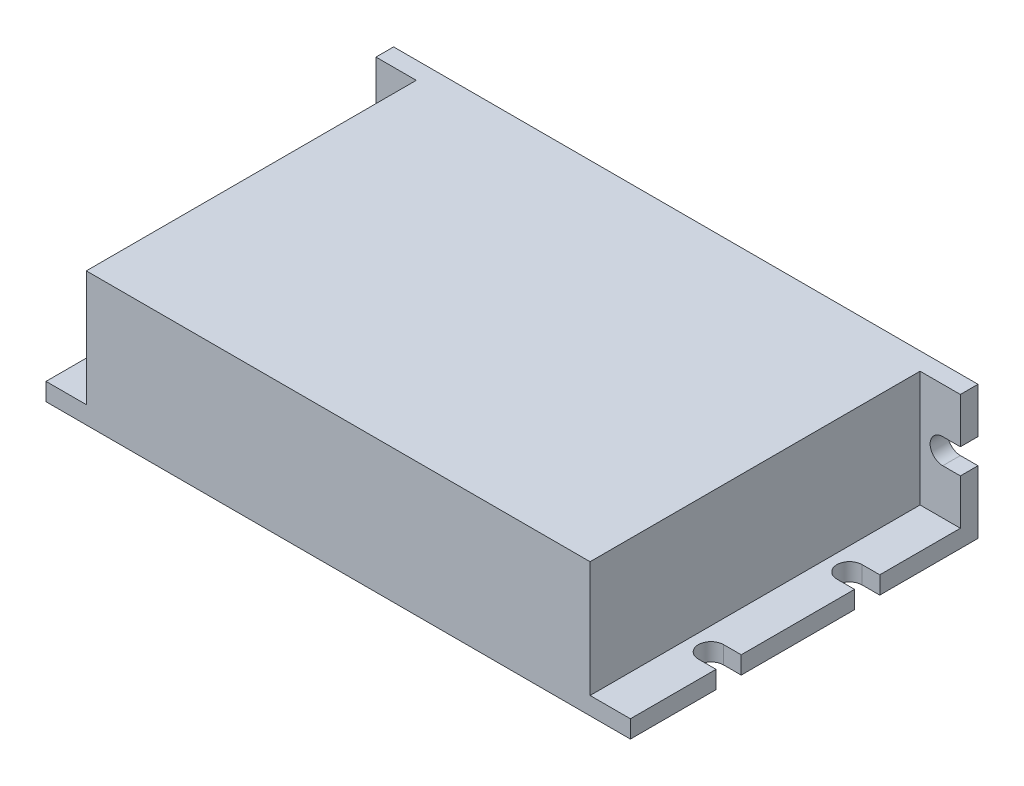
ISO-10303-21;
HEADER;
FILE_DESCRIPTION(('STEP AP214'),'2;1');
FILE_NAME('part.step','',(''),(''),'','','');
FILE_SCHEMA(('AUTOMOTIVE_DESIGN { 1 0 10303 214 1 1 1 1 }'));
ENDSEC;
DATA;
#1=APPLICATION_CONTEXT('core data for automotive mechanical design processes');
#2=APPLICATION_PROTOCOL_DEFINITION('international standard','automotive_design',2000,#1);
#3=PRODUCT_CONTEXT('',#1,'mechanical');
#4=PRODUCT('Part','Part','',(#3));
#5=PRODUCT_RELATED_PRODUCT_CATEGORY('part','',(#4));
#6=PRODUCT_DEFINITION_FORMATION('','',#4);
#7=PRODUCT_DEFINITION_CONTEXT('part definition',#1,'design');
#8=PRODUCT_DEFINITION('design','',#6,#7);
#9=PRODUCT_DEFINITION_SHAPE('','',#8);
#10=(LENGTH_UNIT() NAMED_UNIT(*) SI_UNIT(.MILLI.,.METRE.));
#11=(NAMED_UNIT(*) PLANE_ANGLE_UNIT() SI_UNIT($,.RADIAN.));
#12=(NAMED_UNIT(*) SI_UNIT($,.STERADIAN.) SOLID_ANGLE_UNIT());
#13=UNCERTAINTY_MEASURE_WITH_UNIT(LENGTH_MEASURE(1.E-05),#10,'distance_accuracy_value','');
#14=(GEOMETRIC_REPRESENTATION_CONTEXT(3) GLOBAL_UNCERTAINTY_ASSIGNED_CONTEXT((#13)) GLOBAL_UNIT_ASSIGNED_CONTEXT((#10,
#11,#12)) REPRESENTATION_CONTEXT('',''));
#15=CARTESIAN_POINT('',(0.,0.,0.));
#16=DIRECTION('',(0.,0.,1.));
#17=DIRECTION('',(1.,0.,0.));
#18=AXIS2_PLACEMENT_3D('',#15,#16,#17);
#19=CARTESIAN_POINT('',(0.,0.,0.));
#20=DIRECTION('',(0.,-1.,0.));
#21=DIRECTION('',(0.,0.,-1.));
#22=AXIS2_PLACEMENT_3D('',#19,#20,#21);
#23=PLANE('',#22);
#24=CARTESIAN_POINT('',(3.5,0.,-19.5));
#25=DIRECTION('',(0.,1.,0.));
#26=DIRECTION('',(0.,0.,-1.));
#27=AXIS2_PLACEMENT_3D('',#24,#25,#26);
#28=CIRCLE('',#27,2.5);
#29=CARTESIAN_POINT('',(3.5,0.,-17.));
#30=VERTEX_POINT('',#29);
#31=CARTESIAN_POINT('',(3.5,0.,-22.));
#32=VERTEX_POINT('',#31);
#33=EDGE_CURVE('E286',#30,#32,#28,.T.);
#34=ORIENTED_EDGE('',*,*,#33,.T.);
#35=DIRECTION('',(-1.,0.,0.));
#36=VECTOR('',#35,1.);
#37=CARTESIAN_POINT('',(3.5,0.,-22.));
#38=LINE('',#37,#36);
#39=CARTESIAN_POINT('',(0.,0.,-22.));
#40=VERTEX_POINT('',#39);
#41=EDGE_CURVE('E273',#32,#40,#38,.T.);
#42=ORIENTED_EDGE('',*,*,#41,.T.);
#43=DIRECTION('',(0.,0.,1.));
#44=VECTOR('',#43,1.);
#45=CARTESIAN_POINT('',(0.,0.,0.));
#46=LINE('',#45,#44);
#47=CARTESIAN_POINT('',(0.,0.,-44.5));
#48=VERTEX_POINT('',#47);
#49=EDGE_CURVE('E489',#48,#40,#46,.T.);
#50=ORIENTED_EDGE('',*,*,#49,.F.);
#51=DIRECTION('',(1.,0.,0.));
#52=VECTOR('',#51,1.);
#53=CARTESIAN_POINT('',(3.5,0.,-44.5));
#54=LINE('',#53,#52);
#55=CARTESIAN_POINT('',(3.5,0.,-44.5));
#56=VERTEX_POINT('',#55);
#57=EDGE_CURVE('E274',#48,#56,#54,.T.);
#58=ORIENTED_EDGE('',*,*,#57,.T.);
#59=CARTESIAN_POINT('',(3.5,0.,-47.));
#60=DIRECTION('',(0.,1.,0.));
#61=DIRECTION('',(0.,0.,-1.));
#62=AXIS2_PLACEMENT_3D('',#59,#60,#61);
#63=CIRCLE('',#62,2.5);
#64=CARTESIAN_POINT('',(3.5,0.,-49.5));
#65=VERTEX_POINT('',#64);
#66=EDGE_CURVE('E304',#56,#65,#63,.T.);
#67=ORIENTED_EDGE('',*,*,#66,.T.);
#68=DIRECTION('',(-1.,0.,0.));
#69=VECTOR('',#68,1.);
#70=CARTESIAN_POINT('',(3.5,0.,-49.5));
#71=LINE('',#70,#69);
#72=CARTESIAN_POINT('',(0.,0.,-49.5));
#73=VERTEX_POINT('',#72);
#74=EDGE_CURVE('E297',#65,#73,#71,.T.);
#75=ORIENTED_EDGE('',*,*,#74,.T.);
#76=CARTESIAN_POINT('',(0.,0.,-69.));
#77=VERTEX_POINT('',#76);
#78=EDGE_CURVE('E485',#77,#73,#46,.T.);
#79=ORIENTED_EDGE('',*,*,#78,.F.);
#80=DIRECTION('',(-1.,0.,0.));
#81=VECTOR('',#80,1.);
#82=CARTESIAN_POINT('',(0.,0.,-69.));
#83=LINE('',#82,#81);
#84=CARTESIAN_POINT('',(116.,0.,-69.));
#85=VERTEX_POINT('',#84);
#86=EDGE_CURVE('E477',#85,#77,#83,.T.);
#87=ORIENTED_EDGE('',*,*,#86,.F.);
#88=DIRECTION('',(0.,0.,-1.));
#89=VECTOR('',#88,1.);
#90=CARTESIAN_POINT('',(116.,0.,0.));
#91=LINE('',#90,#89);
#92=CARTESIAN_POINT('',(116.,0.,-49.5));
#93=VERTEX_POINT('',#92);
#94=EDGE_CURVE('E492',#93,#85,#91,.T.);
#95=ORIENTED_EDGE('',*,*,#94,.F.);
#96=DIRECTION('',(-1.,0.,0.));
#97=VECTOR('',#96,1.);
#98=CARTESIAN_POINT('',(112.5,0.,-49.5));
#99=LINE('',#98,#97);
#100=CARTESIAN_POINT('',(112.5,0.,-49.5));
#101=VERTEX_POINT('',#100);
#102=EDGE_CURVE('E341',#93,#101,#99,.T.);
#103=ORIENTED_EDGE('',*,*,#102,.T.);
#104=CARTESIAN_POINT('',(112.5,0.,-47.));
#105=DIRECTION('',(0.,1.,0.));
#106=DIRECTION('',(0.,0.,1.));
#107=AXIS2_PLACEMENT_3D('',#104,#105,#106);
#108=CIRCLE('',#107,2.5);
#109=CARTESIAN_POINT('',(112.5,0.,-44.5));
#110=VERTEX_POINT('',#109);
#111=EDGE_CURVE('E353',#101,#110,#108,.T.);
#112=ORIENTED_EDGE('',*,*,#111,.T.);
#113=DIRECTION('',(1.,0.,0.));
#114=VECTOR('',#113,1.);
#115=CARTESIAN_POINT('',(112.5,0.,-44.5));
#116=LINE('',#115,#114);
#117=CARTESIAN_POINT('',(116.,0.,-44.5));
#118=VERTEX_POINT('',#117);
#119=EDGE_CURVE('E345',#110,#118,#116,.T.);
#120=ORIENTED_EDGE('',*,*,#119,.T.);
#121=CARTESIAN_POINT('',(116.,0.,-22.));
#122=VERTEX_POINT('',#121);
#123=EDGE_CURVE('E496',#122,#118,#91,.T.);
#124=ORIENTED_EDGE('',*,*,#123,.F.);
#125=DIRECTION('',(-1.,0.,0.));
#126=VECTOR('',#125,1.);
#127=CARTESIAN_POINT('',(112.5,0.,-22.));
#128=LINE('',#127,#126);
#129=CARTESIAN_POINT('',(112.5,0.,-22.));
#130=VERTEX_POINT('',#129);
#131=EDGE_CURVE('E316',#122,#130,#128,.T.);
#132=ORIENTED_EDGE('',*,*,#131,.T.);
#133=CARTESIAN_POINT('',(112.5,0.,-19.5));
#134=DIRECTION('',(0.,1.,0.));
#135=DIRECTION('',(0.,0.,1.));
#136=AXIS2_PLACEMENT_3D('',#133,#134,#135);
#137=CIRCLE('',#136,2.5);
#138=CARTESIAN_POINT('',(112.5,0.,-17.));
#139=VERTEX_POINT('',#138);
#140=EDGE_CURVE('E328',#130,#139,#137,.T.);
#141=ORIENTED_EDGE('',*,*,#140,.T.);
#142=DIRECTION('',(1.,0.,0.));
#143=VECTOR('',#142,1.);
#144=CARTESIAN_POINT('',(112.5,0.,-17.));
#145=LINE('',#144,#143);
#146=CARTESIAN_POINT('',(116.,0.,-17.));
#147=VERTEX_POINT('',#146);
#148=EDGE_CURVE('E320',#139,#147,#145,.T.);
#149=ORIENTED_EDGE('',*,*,#148,.T.);
#150=CARTESIAN_POINT('',(116.,0.,0.));
#151=VERTEX_POINT('',#150);
#152=EDGE_CURVE('E493',#151,#147,#91,.T.);
#153=ORIENTED_EDGE('',*,*,#152,.F.);
#154=DIRECTION('',(1.,0.,0.));
#155=VECTOR('',#154,1.);
#156=CARTESIAN_POINT('',(0.,0.,0.));
#157=LINE('',#156,#155);
#158=CARTESIAN_POINT('',(0.,0.,0.));
#159=VERTEX_POINT('',#158);
#160=EDGE_CURVE('E488',#159,#151,#157,.T.);
#161=ORIENTED_EDGE('',*,*,#160,.F.);
#162=CARTESIAN_POINT('',(0.,0.,-17.));
#163=VERTEX_POINT('',#162);
#164=EDGE_CURVE('E467',#163,#159,#46,.T.);
#165=ORIENTED_EDGE('',*,*,#164,.F.);
#166=DIRECTION('',(1.,0.,0.));
#167=VECTOR('',#166,1.);
#168=CARTESIAN_POINT('',(3.5,0.,-17.));
#169=LINE('',#168,#167);
#170=EDGE_CURVE('E267',#163,#30,#169,.T.);
#171=ORIENTED_EDGE('',*,*,#170,.T.);
#172=EDGE_LOOP('',(#34,#42,#50,#58,#67,#75,#79,#87,#95,#103,#112,#120,#124,#132,#141,#149,#153,
#161,#165,#171));
#173=FACE_BOUND('',#172,.T.);
#174=ADVANCED_FACE('F35',(#173),#23,.T.);
#175=CARTESIAN_POINT('',(0.,26.5,0.));
#176=DIRECTION('',(1.,0.,0.));
#177=DIRECTION('',(0.,0.,-1.));
#178=AXIS2_PLACEMENT_3D('',#175,#176,#177);
#179=PLANE('',#178);
#180=DIRECTION('',(0.,-1.,0.));
#181=VECTOR('',#180,1.);
#182=CARTESIAN_POINT('',(0.,3.5,-22.));
#183=LINE('',#182,#181);
#184=CARTESIAN_POINT('',(0.,3.5,-22.));
#185=VERTEX_POINT('',#184);
#186=EDGE_CURVE('E275',#185,#40,#183,.T.);
#187=ORIENTED_EDGE('',*,*,#186,.F.);
#188=DIRECTION('',(0.,0.,1.));
#189=VECTOR('',#188,1.);
#190=CARTESIAN_POINT('',(0.,3.5,-65.5));
#191=LINE('',#190,#189);
#192=CARTESIAN_POINT('',(0.,3.5,-44.5));
#193=VERTEX_POINT('',#192);
#194=EDGE_CURVE('E281',#193,#185,#191,.T.);
#195=ORIENTED_EDGE('',*,*,#194,.F.);
#196=DIRECTION('',(0.,-1.,0.));
#197=VECTOR('',#196,1.);
#198=CARTESIAN_POINT('',(0.,3.5,-44.5));
#199=LINE('',#198,#197);
#200=EDGE_CURVE('E313',#193,#48,#199,.T.);
#201=ORIENTED_EDGE('',*,*,#200,.T.);
#202=ORIENTED_EDGE('',*,*,#49,.T.);
#203=EDGE_LOOP('',(#187,#195,#201,#202));
#204=FACE_BOUND('',#203,.T.);
#205=ADVANCED_FACE('F37',(#204),#179,.F.);
#206=DIRECTION('',(0.,-1.,0.));
#207=VECTOR('',#206,1.);
#208=CARTESIAN_POINT('',(0.,3.5,-17.));
#209=LINE('',#208,#207);
#210=CARTESIAN_POINT('',(0.,3.5,-17.));
#211=VERTEX_POINT('',#210);
#212=EDGE_CURVE('E50',#211,#163,#209,.T.);
#213=ORIENTED_EDGE('',*,*,#212,.T.);
#214=ORIENTED_EDGE('',*,*,#164,.T.);
#215=DIRECTION('',(0.,-1.,0.));
#216=VECTOR('',#215,1.);
#217=CARTESIAN_POINT('',(0.,26.5,0.));
#218=LINE('',#217,#216);
#219=CARTESIAN_POINT('',(0.,3.5,0.));
#220=VERTEX_POINT('',#219);
#221=EDGE_CURVE('E11',#220,#159,#218,.T.);
#222=ORIENTED_EDGE('',*,*,#221,.F.);
#223=EDGE_CURVE('E459',#211,#220,#191,.T.);
#224=ORIENTED_EDGE('',*,*,#223,.F.);
#225=EDGE_LOOP('',(#213,#214,#222,#224));
#226=FACE_BOUND('',#225,.T.);
#227=ADVANCED_FACE('F622',(#226),#179,.F.);
#228=CARTESIAN_POINT('',(0.,3.5,-65.5));
#229=DIRECTION('',(0.,-1.,0.));
#230=DIRECTION('',(0.,0.,-1.));
#231=AXIS2_PLACEMENT_3D('',#228,#229,#230);
#232=PLANE('',#231);
#233=DIRECTION('',(-1.,0.,0.));
#234=VECTOR('',#233,1.);
#235=CARTESIAN_POINT('',(3.5,3.5,-22.));
#236=LINE('',#235,#234);
#237=CARTESIAN_POINT('',(3.5,3.5,-22.));
#238=VERTEX_POINT('',#237);
#239=EDGE_CURVE('E266',#238,#185,#236,.T.);
#240=ORIENTED_EDGE('',*,*,#239,.F.);
#241=CARTESIAN_POINT('',(3.5,3.5,-19.5));
#242=DIRECTION('',(0.,1.,0.));
#243=DIRECTION('',(0.,0.,-1.));
#244=AXIS2_PLACEMENT_3D('',#241,#242,#243);
#245=CIRCLE('',#244,2.5);
#246=CARTESIAN_POINT('',(3.5,3.5,-17.));
#247=VERTEX_POINT('',#246);
#248=EDGE_CURVE('E257',#247,#238,#245,.T.);
#249=ORIENTED_EDGE('',*,*,#248,.F.);
#250=DIRECTION('',(1.,0.,0.));
#251=VECTOR('',#250,1.);
#252=CARTESIAN_POINT('',(3.5,3.5,-17.));
#253=LINE('',#252,#251);
#254=EDGE_CURVE('E282',#211,#247,#253,.T.);
#255=ORIENTED_EDGE('',*,*,#254,.F.);
#256=ORIENTED_EDGE('',*,*,#223,.T.);
#257=DIRECTION('',(1.,0.,0.));
#258=VECTOR('',#257,1.);
#259=CARTESIAN_POINT('',(0.,3.5,0.));
#260=LINE('',#259,#258);
#261=CARTESIAN_POINT('',(8.,3.5,0.));
#262=VERTEX_POINT('',#261);
#263=EDGE_CURVE('E442',#220,#262,#260,.T.);
#264=ORIENTED_EDGE('',*,*,#263,.T.);
#265=DIRECTION('',(0.,0.,1.));
#266=VECTOR('',#265,1.);
#267=CARTESIAN_POINT('',(8.,3.5,-65.5));
#268=LINE('',#267,#266);
#269=CARTESIAN_POINT('',(8.,3.5,-65.5));
#270=VERTEX_POINT('',#269);
#271=EDGE_CURVE('E468',#270,#262,#268,.T.);
#272=ORIENTED_EDGE('',*,*,#271,.F.);
#273=DIRECTION('',(1.,0.,0.));
#274=VECTOR('',#273,1.);
#275=CARTESIAN_POINT('',(0.,3.5,-65.5));
#276=LINE('',#275,#274);
#277=CARTESIAN_POINT('',(0.,3.5,-65.5));
#278=VERTEX_POINT('',#277);
#279=EDGE_CURVE('E451',#278,#270,#276,.T.);
#280=ORIENTED_EDGE('',*,*,#279,.F.);
#281=CARTESIAN_POINT('',(0.,3.5,-49.5));
#282=VERTEX_POINT('',#281);
#283=EDGE_CURVE('E470',#278,#282,#191,.T.);
#284=ORIENTED_EDGE('',*,*,#283,.T.);
#285=DIRECTION('',(-1.,0.,0.));
#286=VECTOR('',#285,1.);
#287=CARTESIAN_POINT('',(3.5,3.5,-49.5));
#288=LINE('',#287,#286);
#289=CARTESIAN_POINT('',(3.5,3.5,-49.5));
#290=VERTEX_POINT('',#289);
#291=EDGE_CURVE('E299',#290,#282,#288,.T.);
#292=ORIENTED_EDGE('',*,*,#291,.F.);
#293=CARTESIAN_POINT('',(3.5,3.5,-47.));
#294=DIRECTION('',(0.,1.,0.));
#295=DIRECTION('',(0.,0.,-1.));
#296=AXIS2_PLACEMENT_3D('',#293,#294,#295);
#297=CIRCLE('',#296,2.5);
#298=CARTESIAN_POINT('',(3.5,3.5,-44.5));
#299=VERTEX_POINT('',#298);
#300=EDGE_CURVE('E296',#299,#290,#297,.T.);
#301=ORIENTED_EDGE('',*,*,#300,.F.);
#302=DIRECTION('',(1.,0.,0.));
#303=VECTOR('',#302,1.);
#304=CARTESIAN_POINT('',(3.5,3.5,-44.5));
#305=LINE('',#304,#303);
#306=EDGE_CURVE('E294',#193,#299,#305,.T.);
#307=ORIENTED_EDGE('',*,*,#306,.F.);
#308=ORIENTED_EDGE('',*,*,#194,.T.);
#309=EDGE_LOOP('',(#240,#249,#255,#256,#264,#272,#280,#284,#292,#301,#307,#308));
#310=FACE_BOUND('',#309,.T.);
#311=ADVANCED_FACE('F278',(#310),#232,.F.);
#312=DIRECTION('',(0.,-1.,0.));
#313=VECTOR('',#312,1.);
#314=CARTESIAN_POINT('',(0.,3.5,-49.5));
#315=LINE('',#314,#313);
#316=EDGE_CURVE('E301',#282,#73,#315,.T.);
#317=ORIENTED_EDGE('',*,*,#316,.F.);
#318=ORIENTED_EDGE('',*,*,#283,.F.);
#319=DIRECTION('',(0.,-1.,0.));
#320=VECTOR('',#319,1.);
#321=CARTESIAN_POINT('',(0.,26.5,-65.5));
#322=LINE('',#321,#320);
#323=CARTESIAN_POINT('',(0.,12.5,-65.5));
#324=VERTEX_POINT('',#323);
#325=EDGE_CURVE('E452',#324,#278,#322,.T.);
#326=ORIENTED_EDGE('',*,*,#325,.F.);
#327=DIRECTION('',(0.,0.,1.));
#328=VECTOR('',#327,1.);
#329=CARTESIAN_POINT('',(0.,12.5,-69.));
#330=LINE('',#329,#328);
#331=CARTESIAN_POINT('',(0.,12.5,-69.));
#332=VERTEX_POINT('',#331);
#333=EDGE_CURVE('E404',#332,#324,#330,.T.);
#334=ORIENTED_EDGE('',*,*,#333,.F.);
#335=DIRECTION('',(0.,-1.,0.));
#336=VECTOR('',#335,1.);
#337=CARTESIAN_POINT('',(0.,26.5,-69.));
#338=LINE('',#337,#336);
#339=EDGE_CURVE('E484',#332,#77,#338,.T.);
#340=ORIENTED_EDGE('',*,*,#339,.T.);
#341=ORIENTED_EDGE('',*,*,#78,.T.);
#342=EDGE_LOOP('',(#317,#318,#326,#334,#340,#341));
#343=FACE_BOUND('',#342,.T.);
#344=ADVANCED_FACE('F555',(#343),#179,.F.);
#345=CARTESIAN_POINT('',(116.,26.5,0.));
#346=DIRECTION('',(-1.,0.,0.));
#347=DIRECTION('',(0.,0.,1.));
#348=AXIS2_PLACEMENT_3D('',#345,#346,#347);
#349=PLANE('',#348);
#350=DIRECTION('',(0.,-1.,0.));
#351=VECTOR('',#350,1.);
#352=CARTESIAN_POINT('',(116.,3.5,-22.));
#353=LINE('',#352,#351);
#354=CARTESIAN_POINT('',(116.,3.5,-22.));
#355=VERTEX_POINT('',#354);
#356=EDGE_CURVE('E338',#355,#122,#353,.T.);
#357=ORIENTED_EDGE('',*,*,#356,.T.);
#358=ORIENTED_EDGE('',*,*,#123,.T.);
#359=DIRECTION('',(0.,-1.,0.));
#360=VECTOR('',#359,1.);
#361=CARTESIAN_POINT('',(116.,3.5,-44.5));
#362=LINE('',#361,#360);
#363=CARTESIAN_POINT('',(116.,3.5,-44.5));
#364=VERTEX_POINT('',#363);
#365=EDGE_CURVE('E350',#364,#118,#362,.T.);
#366=ORIENTED_EDGE('',*,*,#365,.F.);
#367=DIRECTION('',(0.,0.,1.));
#368=VECTOR('',#367,1.);
#369=CARTESIAN_POINT('',(116.,3.5,-65.5));
#370=LINE('',#369,#368);
#371=EDGE_CURVE('E443',#364,#355,#370,.T.);
#372=ORIENTED_EDGE('',*,*,#371,.T.);
#373=EDGE_LOOP('',(#357,#358,#366,#372));
#374=FACE_BOUND('',#373,.T.);
#375=ADVANCED_FACE('F532',(#374),#349,.F.);
#376=DIRECTION('',(0.,-1.,0.));
#377=VECTOR('',#376,1.);
#378=CARTESIAN_POINT('',(116.,3.5,-17.));
#379=LINE('',#378,#377);
#380=CARTESIAN_POINT('',(116.,3.5,-17.));
#381=VERTEX_POINT('',#380);
#382=EDGE_CURVE('E325',#381,#147,#379,.T.);
#383=ORIENTED_EDGE('',*,*,#382,.F.);
#384=CARTESIAN_POINT('',(116.,3.5,0.));
#385=VERTEX_POINT('',#384);
#386=EDGE_CURVE('E444',#381,#385,#370,.T.);
#387=ORIENTED_EDGE('',*,*,#386,.T.);
#388=DIRECTION('',(0.,-1.,0.));
#389=VECTOR('',#388,1.);
#390=CARTESIAN_POINT('',(116.,26.5,0.));
#391=LINE('',#390,#389);
#392=EDGE_CURVE('E43',#385,#151,#391,.T.);
#393=ORIENTED_EDGE('',*,*,#392,.T.);
#394=ORIENTED_EDGE('',*,*,#152,.T.);
#395=EDGE_LOOP('',(#383,#387,#393,#394));
#396=FACE_BOUND('',#395,.T.);
#397=ADVANCED_FACE('F508',(#396),#349,.F.);
#398=CARTESIAN_POINT('',(116.,3.5,-65.5));
#399=DIRECTION('',(0.,-1.,0.));
#400=DIRECTION('',(0.,0.,-1.));
#401=AXIS2_PLACEMENT_3D('',#398,#399,#400);
#402=PLANE('',#401);
#403=DIRECTION('',(-1.,0.,0.));
#404=VECTOR('',#403,1.);
#405=CARTESIAN_POINT('',(112.5,3.5,-22.));
#406=LINE('',#405,#404);
#407=CARTESIAN_POINT('',(112.5,3.5,-22.));
#408=VERTEX_POINT('',#407);
#409=EDGE_CURVE('E317',#355,#408,#406,.T.);
#410=ORIENTED_EDGE('',*,*,#409,.F.);
#411=ORIENTED_EDGE('',*,*,#371,.F.);
#412=DIRECTION('',(1.,0.,0.));
#413=VECTOR('',#412,1.);
#414=CARTESIAN_POINT('',(112.5,3.5,-44.5));
#415=LINE('',#414,#413);
#416=CARTESIAN_POINT('',(112.5,3.5,-44.5));
#417=VERTEX_POINT('',#416);
#418=EDGE_CURVE('E348',#417,#364,#415,.T.);
#419=ORIENTED_EDGE('',*,*,#418,.F.);
#420=CARTESIAN_POINT('',(112.5,3.5,-47.));
#421=DIRECTION('',(0.,1.,0.));
#422=DIRECTION('',(0.,0.,1.));
#423=AXIS2_PLACEMENT_3D('',#420,#421,#422);
#424=CIRCLE('',#423,2.5);
#425=CARTESIAN_POINT('',(112.5,3.5,-49.5));
#426=VERTEX_POINT('',#425);
#427=EDGE_CURVE('E344',#426,#417,#424,.T.);
#428=ORIENTED_EDGE('',*,*,#427,.F.);
#429=DIRECTION('',(-1.,0.,0.));
#430=VECTOR('',#429,1.);
#431=CARTESIAN_POINT('',(112.5,3.5,-49.5));
#432=LINE('',#431,#430);
#433=CARTESIAN_POINT('',(116.,3.5,-49.5));
#434=VERTEX_POINT('',#433);
#435=EDGE_CURVE('E342',#434,#426,#432,.T.);
#436=ORIENTED_EDGE('',*,*,#435,.F.);
#437=CARTESIAN_POINT('',(116.,3.5,-65.5));
#438=VERTEX_POINT('',#437);
#439=EDGE_CURVE('E439',#438,#434,#370,.T.);
#440=ORIENTED_EDGE('',*,*,#439,.F.);
#441=DIRECTION('',(1.,0.,0.));
#442=VECTOR('',#441,1.);
#443=CARTESIAN_POINT('',(116.,3.5,-65.5));
#444=LINE('',#443,#442);
#445=CARTESIAN_POINT('',(108.,3.5,-65.5));
#446=VERTEX_POINT('',#445);
#447=EDGE_CURVE('E430',#446,#438,#444,.T.);
#448=ORIENTED_EDGE('',*,*,#447,.F.);
#449=DIRECTION('',(0.,0.,1.));
#450=VECTOR('',#449,1.);
#451=CARTESIAN_POINT('',(108.,3.5,-65.5));
#452=LINE('',#451,#450);
#453=CARTESIAN_POINT('',(108.,3.5,0.));
#454=VERTEX_POINT('',#453);
#455=EDGE_CURVE('E445',#446,#454,#452,.T.);
#456=ORIENTED_EDGE('',*,*,#455,.T.);
#457=DIRECTION('',(1.,0.,0.));
#458=VECTOR('',#457,1.);
#459=CARTESIAN_POINT('',(116.,3.5,0.));
#460=LINE('',#459,#458);
#461=EDGE_CURVE('E436',#454,#385,#460,.T.);
#462=ORIENTED_EDGE('',*,*,#461,.T.);
#463=ORIENTED_EDGE('',*,*,#386,.F.);
#464=DIRECTION('',(1.,0.,0.));
#465=VECTOR('',#464,1.);
#466=CARTESIAN_POINT('',(112.5,3.5,-17.));
#467=LINE('',#466,#465);
#468=CARTESIAN_POINT('',(112.5,3.5,-17.));
#469=VERTEX_POINT('',#468);
#470=EDGE_CURVE('E323',#469,#381,#467,.T.);
#471=ORIENTED_EDGE('',*,*,#470,.F.);
#472=CARTESIAN_POINT('',(112.5,3.5,-19.5));
#473=DIRECTION('',(0.,1.,0.));
#474=DIRECTION('',(0.,0.,1.));
#475=AXIS2_PLACEMENT_3D('',#472,#473,#474);
#476=CIRCLE('',#475,2.5);
#477=EDGE_CURVE('E319',#408,#469,#476,.T.);
#478=ORIENTED_EDGE('',*,*,#477,.F.);
#479=EDGE_LOOP('',(#410,#411,#419,#428,#436,#440,#448,#456,#462,#463,#471,#478));
#480=FACE_BOUND('',#479,.T.);
#481=ADVANCED_FACE('F526',(#480),#402,.F.);
#482=DIRECTION('',(0.,-1.,0.));
#483=VECTOR('',#482,1.);
#484=CARTESIAN_POINT('',(116.,3.5,-49.5));
#485=LINE('',#484,#483);
#486=EDGE_CURVE('E364',#434,#93,#485,.T.);
#487=ORIENTED_EDGE('',*,*,#486,.T.);
#488=ORIENTED_EDGE('',*,*,#94,.T.);
#489=DIRECTION('',(0.,-1.,0.));
#490=VECTOR('',#489,1.);
#491=CARTESIAN_POINT('',(116.,26.5,-69.));
#492=LINE('',#491,#490);
#493=CARTESIAN_POINT('',(116.,12.5,-69.));
#494=VERTEX_POINT('',#493);
#495=EDGE_CURVE('E502',#494,#85,#492,.T.);
#496=ORIENTED_EDGE('',*,*,#495,.F.);
#497=DIRECTION('',(0.,0.,1.));
#498=VECTOR('',#497,1.);
#499=CARTESIAN_POINT('',(116.,12.5,-69.));
#500=LINE('',#499,#498);
#501=CARTESIAN_POINT('',(116.,12.5,-65.5));
#502=VERTEX_POINT('',#501);
#503=EDGE_CURVE('E385',#494,#502,#500,.T.);
#504=ORIENTED_EDGE('',*,*,#503,.T.);
#505=DIRECTION('',(0.,1.,0.));
#506=VECTOR('',#505,1.);
#507=CARTESIAN_POINT('',(116.,26.5,-65.5));
#508=LINE('',#507,#506);
#509=EDGE_CURVE('E420',#438,#502,#508,.T.);
#510=ORIENTED_EDGE('',*,*,#509,.F.);
#511=ORIENTED_EDGE('',*,*,#439,.T.);
#512=EDGE_LOOP('',(#487,#488,#496,#504,#510,#511));
#513=FACE_BOUND('',#512,.T.);
#514=ADVANCED_FACE('F546',(#513),#349,.F.);
#515=CARTESIAN_POINT('',(0.,26.5,-69.));
#516=VERTEX_POINT('',#515);
#517=CARTESIAN_POINT('',(0.,17.5,-69.));
#518=VERTEX_POINT('',#517);
#519=EDGE_CURVE('E499',#516,#518,#338,.T.);
#520=ORIENTED_EDGE('',*,*,#519,.T.);
#521=DIRECTION('',(0.,0.,1.));
#522=VECTOR('',#521,1.);
#523=CARTESIAN_POINT('',(0.,17.5,-69.));
#524=LINE('',#523,#522);
#525=CARTESIAN_POINT('',(0.,17.5,-65.5));
#526=VERTEX_POINT('',#525);
#527=EDGE_CURVE('E411',#518,#526,#524,.T.);
#528=ORIENTED_EDGE('',*,*,#527,.T.);
#529=CARTESIAN_POINT('',(0.,26.5,-65.5));
#530=VERTEX_POINT('',#529);
#531=EDGE_CURVE('E448',#530,#526,#322,.T.);
#532=ORIENTED_EDGE('',*,*,#531,.F.);
#533=DIRECTION('',(0.,0.,1.));
#534=VECTOR('',#533,1.);
#535=CARTESIAN_POINT('',(0.,26.5,0.));
#536=LINE('',#535,#534);
#537=EDGE_CURVE('E473',#516,#530,#536,.T.);
#538=ORIENTED_EDGE('',*,*,#537,.F.);
#539=EDGE_LOOP('',(#520,#528,#532,#538));
#540=FACE_BOUND('',#539,.T.);
#541=ADVANCED_FACE('F574',(#540),#179,.F.);
#542=CARTESIAN_POINT('',(0.,26.5,0.));
#543=DIRECTION('',(0.,0.,-1.));
#544=DIRECTION('',(-1.,0.,0.));
#545=AXIS2_PLACEMENT_3D('',#542,#543,#544);
#546=PLANE('',#545);
#547=ORIENTED_EDGE('',*,*,#392,.F.);
#548=ORIENTED_EDGE('',*,*,#461,.F.);
#549=DIRECTION('',(0.,-1.,0.));
#550=VECTOR('',#549,1.);
#551=CARTESIAN_POINT('',(108.,26.5,0.));
#552=LINE('',#551,#550);
#553=CARTESIAN_POINT('',(108.,26.5,0.));
#554=VERTEX_POINT('',#553);
#555=EDGE_CURVE('E414',#554,#454,#552,.T.);
#556=ORIENTED_EDGE('',*,*,#555,.F.);
#557=DIRECTION('',(1.,0.,0.));
#558=VECTOR('',#557,1.);
#559=CARTESIAN_POINT('',(0.,26.5,0.));
#560=LINE('',#559,#558);
#561=CARTESIAN_POINT('',(8.,26.5,0.));
#562=VERTEX_POINT('',#561);
#563=EDGE_CURVE('E476',#562,#554,#560,.T.);
#564=ORIENTED_EDGE('',*,*,#563,.F.);
#565=DIRECTION('',(0.,1.,0.));
#566=VECTOR('',#565,1.);
#567=CARTESIAN_POINT('',(8.,26.5,0.));
#568=LINE('',#567,#566);
#569=EDGE_CURVE('E462',#262,#562,#568,.T.);
#570=ORIENTED_EDGE('',*,*,#569,.F.);
#571=ORIENTED_EDGE('',*,*,#263,.F.);
#572=ORIENTED_EDGE('',*,*,#221,.T.);
#573=ORIENTED_EDGE('',*,*,#160,.T.);
#574=EDGE_LOOP('',(#547,#548,#556,#564,#570,#571,#572,#573));
#575=FACE_BOUND('',#574,.T.);
#576=ADVANCED_FACE('F514',(#575),#546,.F.);
#577=CARTESIAN_POINT('',(116.,17.5,-65.5));
#578=VERTEX_POINT('',#577);
#579=CARTESIAN_POINT('',(116.,26.5,-65.5));
#580=VERTEX_POINT('',#579);
#581=EDGE_CURVE('E424',#578,#580,#508,.T.);
#582=ORIENTED_EDGE('',*,*,#581,.F.);
#583=DIRECTION('',(0.,0.,1.));
#584=VECTOR('',#583,1.);
#585=CARTESIAN_POINT('',(116.,17.5,-69.));
#586=LINE('',#585,#584);
#587=CARTESIAN_POINT('',(116.,17.5,-69.));
#588=VERTEX_POINT('',#587);
#589=EDGE_CURVE('E378',#588,#578,#586,.T.);
#590=ORIENTED_EDGE('',*,*,#589,.F.);
#591=CARTESIAN_POINT('',(116.,26.5,-69.));
#592=VERTEX_POINT('',#591);
#593=EDGE_CURVE('E503',#592,#588,#492,.T.);
#594=ORIENTED_EDGE('',*,*,#593,.F.);
#595=DIRECTION('',(0.,0.,-1.));
#596=VECTOR('',#595,1.);
#597=CARTESIAN_POINT('',(116.,26.5,0.));
#598=LINE('',#597,#596);
#599=EDGE_CURVE('E480',#580,#592,#598,.T.);
#600=ORIENTED_EDGE('',*,*,#599,.F.);
#601=EDGE_LOOP('',(#582,#590,#594,#600));
#602=FACE_BOUND('',#601,.T.);
#603=ADVANCED_FACE('F585',(#602),#349,.F.);
#604=CARTESIAN_POINT('',(0.,26.5,-69.));
#605=DIRECTION('',(0.,0.,1.));
#606=DIRECTION('',(1.,0.,0.));
#607=AXIS2_PLACEMENT_3D('',#604,#605,#606);
#608=PLANE('',#607);
#609=CARTESIAN_POINT('',(112.5,15.,-69.));
#610=DIRECTION('',(0.,0.,1.));
#611=DIRECTION('',(1.,0.,0.));
#612=AXIS2_PLACEMENT_3D('',#609,#610,#611);
#613=CIRCLE('',#612,2.5);
#614=CARTESIAN_POINT('',(112.5,17.5,-69.));
#615=VERTEX_POINT('',#614);
#616=CARTESIAN_POINT('',(112.5,12.5,-69.));
#617=VERTEX_POINT('',#616);
#618=EDGE_CURVE('E371',#615,#617,#613,.T.);
#619=ORIENTED_EDGE('',*,*,#618,.T.);
#620=DIRECTION('',(1.,0.,0.));
#621=VECTOR('',#620,1.);
#622=CARTESIAN_POINT('',(112.5,12.5,-69.));
#623=LINE('',#622,#621);
#624=EDGE_CURVE('E375',#617,#494,#623,.T.);
#625=ORIENTED_EDGE('',*,*,#624,.T.);
#626=ORIENTED_EDGE('',*,*,#495,.T.);
#627=ORIENTED_EDGE('',*,*,#86,.T.);
#628=ORIENTED_EDGE('',*,*,#339,.F.);
#629=DIRECTION('',(1.,0.,0.));
#630=VECTOR('',#629,1.);
#631=CARTESIAN_POINT('',(3.5,12.5,-69.));
#632=LINE('',#631,#630);
#633=CARTESIAN_POINT('',(3.5,12.5,-69.));
#634=VERTEX_POINT('',#633);
#635=EDGE_CURVE('E394',#332,#634,#632,.T.);
#636=ORIENTED_EDGE('',*,*,#635,.T.);
#637=CARTESIAN_POINT('',(3.5,15.,-69.));
#638=DIRECTION('',(0.,0.,1.));
#639=DIRECTION('',(-1.,0.,0.));
#640=AXIS2_PLACEMENT_3D('',#637,#638,#639);
#641=CIRCLE('',#640,2.5);
#642=CARTESIAN_POINT('',(3.5,17.5,-69.));
#643=VERTEX_POINT('',#642);
#644=EDGE_CURVE('E397',#634,#643,#641,.T.);
#645=ORIENTED_EDGE('',*,*,#644,.T.);
#646=DIRECTION('',(-1.,0.,0.));
#647=VECTOR('',#646,1.);
#648=CARTESIAN_POINT('',(3.5,17.5,-69.));
#649=LINE('',#648,#647);
#650=EDGE_CURVE('E401',#643,#518,#649,.T.);
#651=ORIENTED_EDGE('',*,*,#650,.T.);
#652=ORIENTED_EDGE('',*,*,#519,.F.);
#653=DIRECTION('',(-1.,0.,0.));
#654=VECTOR('',#653,1.);
#655=CARTESIAN_POINT('',(0.,26.5,-69.));
#656=LINE('',#655,#654);
#657=EDGE_CURVE('E482',#592,#516,#656,.T.);
#658=ORIENTED_EDGE('',*,*,#657,.F.);
#659=ORIENTED_EDGE('',*,*,#593,.T.);
#660=DIRECTION('',(-1.,0.,0.));
#661=VECTOR('',#660,1.);
#662=CARTESIAN_POINT('',(112.5,17.5,-69.));
#663=LINE('',#662,#661);
#664=EDGE_CURVE('E368',#588,#615,#663,.T.);
#665=ORIENTED_EDGE('',*,*,#664,.T.);
#666=EDGE_LOOP('',(#619,#625,#626,#627,#628,#636,#645,#651,#652,#658,#659,#665));
#667=FACE_BOUND('',#666,.T.);
#668=ADVANCED_FACE('F549',(#667),#608,.F.);
#669=CARTESIAN_POINT('',(0.,26.5,0.));
#670=DIRECTION('',(0.,-1.,0.));
#671=DIRECTION('',(0.,0.,-1.));
#672=AXIS2_PLACEMENT_3D('',#669,#670,#671);
#673=PLANE('',#672);
#674=ORIENTED_EDGE('',*,*,#563,.T.);
#675=DIRECTION('',(0.,0.,1.));
#676=VECTOR('',#675,1.);
#677=CARTESIAN_POINT('',(108.,26.5,-65.5));
#678=LINE('',#677,#676);
#679=CARTESIAN_POINT('',(108.,26.5,-65.5));
#680=VERTEX_POINT('',#679);
#681=EDGE_CURVE('E433',#680,#554,#678,.T.);
#682=ORIENTED_EDGE('',*,*,#681,.F.);
#683=DIRECTION('',(-1.,0.,0.));
#684=VECTOR('',#683,1.);
#685=CARTESIAN_POINT('',(116.,26.5,-65.5));
#686=LINE('',#685,#684);
#687=EDGE_CURVE('E423',#580,#680,#686,.T.);
#688=ORIENTED_EDGE('',*,*,#687,.F.);
#689=ORIENTED_EDGE('',*,*,#599,.T.);
#690=ORIENTED_EDGE('',*,*,#657,.T.);
#691=ORIENTED_EDGE('',*,*,#537,.T.);
#692=DIRECTION('',(-1.,0.,0.));
#693=VECTOR('',#692,1.);
#694=CARTESIAN_POINT('',(0.,26.5,-65.5));
#695=LINE('',#694,#693);
#696=CARTESIAN_POINT('',(8.,26.5,-65.5));
#697=VERTEX_POINT('',#696);
#698=EDGE_CURVE('E457',#697,#530,#695,.T.);
#699=ORIENTED_EDGE('',*,*,#698,.F.);
#700=DIRECTION('',(0.,0.,1.));
#701=VECTOR('',#700,1.);
#702=CARTESIAN_POINT('',(8.,26.5,-65.5));
#703=LINE('',#702,#701);
#704=EDGE_CURVE('E464',#697,#562,#703,.T.);
#705=ORIENTED_EDGE('',*,*,#704,.T.);
#706=EDGE_LOOP('',(#674,#682,#688,#689,#690,#691,#699,#705));
#707=FACE_BOUND('',#706,.T.);
#708=ADVANCED_FACE('F578',(#707),#673,.F.);
#709=CARTESIAN_POINT('',(8.,26.5,-65.5));
#710=DIRECTION('',(1.,0.,0.));
#711=DIRECTION('',(0.,0.,-1.));
#712=AXIS2_PLACEMENT_3D('',#709,#710,#711);
#713=PLANE('',#712);
#714=ORIENTED_EDGE('',*,*,#569,.T.);
#715=ORIENTED_EDGE('',*,*,#704,.F.);
#716=DIRECTION('',(0.,1.,0.));
#717=VECTOR('',#716,1.);
#718=CARTESIAN_POINT('',(8.,26.5,-65.5));
#719=LINE('',#718,#717);
#720=EDGE_CURVE('E455',#270,#697,#719,.T.);
#721=ORIENTED_EDGE('',*,*,#720,.F.);
#722=ORIENTED_EDGE('',*,*,#271,.T.);
#723=EDGE_LOOP('',(#714,#715,#721,#722));
#724=FACE_BOUND('',#723,.T.);
#725=ADVANCED_FACE('F664',(#724),#713,.F.);
#726=CARTESIAN_POINT('',(0.,0.,-65.5));
#727=DIRECTION('',(0.,0.,1.));
#728=DIRECTION('',(1.,0.,0.));
#729=AXIS2_PLACEMENT_3D('',#726,#727,#728);
#730=PLANE('',#729);
#731=DIRECTION('',(-1.,0.,0.));
#732=VECTOR('',#731,1.);
#733=CARTESIAN_POINT('',(3.5,17.5,-65.5));
#734=LINE('',#733,#732);
#735=CARTESIAN_POINT('',(3.5,17.5,-65.5));
#736=VERTEX_POINT('',#735);
#737=EDGE_CURVE('E398',#736,#526,#734,.T.);
#738=ORIENTED_EDGE('',*,*,#737,.F.);
#739=CARTESIAN_POINT('',(3.5,15.,-65.5));
#740=DIRECTION('',(0.,0.,1.));
#741=DIRECTION('',(-1.,0.,0.));
#742=AXIS2_PLACEMENT_3D('',#739,#740,#741);
#743=CIRCLE('',#742,2.5);
#744=CARTESIAN_POINT('',(3.5,12.5,-65.5));
#745=VERTEX_POINT('',#744);
#746=EDGE_CURVE('E407',#745,#736,#743,.T.);
#747=ORIENTED_EDGE('',*,*,#746,.F.);
#748=DIRECTION('',(1.,0.,0.));
#749=VECTOR('',#748,1.);
#750=CARTESIAN_POINT('',(3.5,12.5,-65.5));
#751=LINE('',#750,#749);
#752=EDGE_CURVE('E388',#324,#745,#751,.T.);
#753=ORIENTED_EDGE('',*,*,#752,.F.);
#754=ORIENTED_EDGE('',*,*,#325,.T.);
#755=ORIENTED_EDGE('',*,*,#279,.T.);
#756=ORIENTED_EDGE('',*,*,#720,.T.);
#757=ORIENTED_EDGE('',*,*,#698,.T.);
#758=ORIENTED_EDGE('',*,*,#531,.T.);
#759=EDGE_LOOP('',(#738,#747,#753,#754,#755,#756,#757,#758));
#760=FACE_BOUND('',#759,.T.);
#761=ADVANCED_FACE('F660',(#760),#730,.T.);
#762=CARTESIAN_POINT('',(108.,26.5,-65.5));
#763=DIRECTION('',(-1.,0.,0.));
#764=DIRECTION('',(0.,0.,1.));
#765=AXIS2_PLACEMENT_3D('',#762,#763,#764);
#766=PLANE('',#765);
#767=ORIENTED_EDGE('',*,*,#555,.T.);
#768=ORIENTED_EDGE('',*,*,#455,.F.);
#769=DIRECTION('',(0.,-1.,0.));
#770=VECTOR('',#769,1.);
#771=CARTESIAN_POINT('',(108.,26.5,-65.5));
#772=LINE('',#771,#770);
#773=EDGE_CURVE('E427',#680,#446,#772,.T.);
#774=ORIENTED_EDGE('',*,*,#773,.F.);
#775=ORIENTED_EDGE('',*,*,#681,.T.);
#776=EDGE_LOOP('',(#767,#768,#774,#775));
#777=FACE_BOUND('',#776,.T.);
#778=ADVANCED_FACE('F670',(#777),#766,.F.);
#779=CARTESIAN_POINT('',(0.,0.,-65.5));
#780=DIRECTION('',(0.,0.,-1.));
#781=DIRECTION('',(-1.,0.,0.));
#782=AXIS2_PLACEMENT_3D('',#779,#780,#781);
#783=PLANE('',#782);
#784=ORIENTED_EDGE('',*,*,#509,.T.);
#785=DIRECTION('',(1.,0.,0.));
#786=VECTOR('',#785,1.);
#787=CARTESIAN_POINT('',(112.5,12.5,-65.5));
#788=LINE('',#787,#786);
#789=CARTESIAN_POINT('',(112.5,12.5,-65.5));
#790=VERTEX_POINT('',#789);
#791=EDGE_CURVE('E372',#790,#502,#788,.T.);
#792=ORIENTED_EDGE('',*,*,#791,.F.);
#793=CARTESIAN_POINT('',(112.5,15.,-65.5));
#794=DIRECTION('',(0.,0.,1.));
#795=DIRECTION('',(1.,0.,0.));
#796=AXIS2_PLACEMENT_3D('',#793,#794,#795);
#797=CIRCLE('',#796,2.5);
#798=CARTESIAN_POINT('',(112.5,17.5,-65.5));
#799=VERTEX_POINT('',#798);
#800=EDGE_CURVE('E381',#799,#790,#797,.T.);
#801=ORIENTED_EDGE('',*,*,#800,.F.);
#802=DIRECTION('',(-1.,0.,0.));
#803=VECTOR('',#802,1.);
#804=CARTESIAN_POINT('',(112.5,17.5,-65.5));
#805=LINE('',#804,#803);
#806=EDGE_CURVE('E367',#578,#799,#805,.T.);
#807=ORIENTED_EDGE('',*,*,#806,.F.);
#808=ORIENTED_EDGE('',*,*,#581,.T.);
#809=ORIENTED_EDGE('',*,*,#687,.T.);
#810=ORIENTED_EDGE('',*,*,#773,.T.);
#811=ORIENTED_EDGE('',*,*,#447,.T.);
#812=EDGE_LOOP('',(#784,#792,#801,#807,#808,#809,#810,#811));
#813=FACE_BOUND('',#812,.T.);
#814=ADVANCED_FACE('F591',(#813),#783,.F.);
#815=CARTESIAN_POINT('',(3.5,17.5,-69.));
#816=DIRECTION('',(0.,1.,0.));
#817=DIRECTION('',(0.,0.,1.));
#818=AXIS2_PLACEMENT_3D('',#815,#816,#817);
#819=PLANE('',#818);
#820=ORIENTED_EDGE('',*,*,#737,.T.);
#821=ORIENTED_EDGE('',*,*,#527,.F.);
#822=ORIENTED_EDGE('',*,*,#650,.F.);
#823=DIRECTION('',(0.,0.,1.));
#824=VECTOR('',#823,1.);
#825=CARTESIAN_POINT('',(3.5,17.5,-69.));
#826=LINE('',#825,#824);
#827=EDGE_CURVE('E415',#643,#736,#826,.T.);
#828=ORIENTED_EDGE('',*,*,#827,.T.);
#829=EDGE_LOOP('',(#820,#821,#822,#828));
#830=FACE_BOUND('',#829,.T.);
#831=ADVANCED_FACE('F569',(#830),#819,.F.);
#832=CARTESIAN_POINT('',(3.5,15.,-69.));
#833=DIRECTION('',(0.,0.,1.));
#834=DIRECTION('',(1.,0.,0.));
#835=AXIS2_PLACEMENT_3D('',#832,#833,#834);
#836=CYLINDRICAL_SURFACE('',#835,2.5);
#837=ORIENTED_EDGE('',*,*,#746,.T.);
#838=ORIENTED_EDGE('',*,*,#827,.F.);
#839=ORIENTED_EDGE('',*,*,#644,.F.);
#840=DIRECTION('',(0.,0.,1.));
#841=VECTOR('',#840,1.);
#842=CARTESIAN_POINT('',(3.5,12.5,-69.));
#843=LINE('',#842,#841);
#844=EDGE_CURVE('E417',#634,#745,#843,.T.);
#845=ORIENTED_EDGE('',*,*,#844,.T.);
#846=EDGE_LOOP('',(#837,#838,#839,#845));
#847=FACE_BOUND('',#846,.T.);
#848=ADVANCED_FACE('F565',(#847),#836,.F.);
#849=CARTESIAN_POINT('',(3.5,12.5,-69.));
#850=DIRECTION('',(0.,-1.,0.));
#851=DIRECTION('',(0.,0.,-1.));
#852=AXIS2_PLACEMENT_3D('',#849,#850,#851);
#853=PLANE('',#852);
#854=ORIENTED_EDGE('',*,*,#752,.T.);
#855=ORIENTED_EDGE('',*,*,#844,.F.);
#856=ORIENTED_EDGE('',*,*,#635,.F.);
#857=ORIENTED_EDGE('',*,*,#333,.T.);
#858=EDGE_LOOP('',(#854,#855,#856,#857));
#859=FACE_BOUND('',#858,.T.);
#860=ADVANCED_FACE('F561',(#859),#853,.F.);
#861=CARTESIAN_POINT('',(112.5,12.5,-69.));
#862=DIRECTION('',(0.,-1.,0.));
#863=DIRECTION('',(0.,0.,-1.));
#864=AXIS2_PLACEMENT_3D('',#861,#862,#863);
#865=PLANE('',#864);
#866=ORIENTED_EDGE('',*,*,#791,.T.);
#867=ORIENTED_EDGE('',*,*,#503,.F.);
#868=ORIENTED_EDGE('',*,*,#624,.F.);
#869=DIRECTION('',(0.,0.,1.));
#870=VECTOR('',#869,1.);
#871=CARTESIAN_POINT('',(112.5,12.5,-69.));
#872=LINE('',#871,#870);
#873=EDGE_CURVE('E389',#617,#790,#872,.T.);
#874=ORIENTED_EDGE('',*,*,#873,.T.);
#875=EDGE_LOOP('',(#866,#867,#868,#874));
#876=FACE_BOUND('',#875,.T.);
#877=ADVANCED_FACE('F597',(#876),#865,.F.);
#878=CARTESIAN_POINT('',(112.5,15.,-69.));
#879=DIRECTION('',(0.,0.,1.));
#880=DIRECTION('',(1.,0.,0.));
#881=AXIS2_PLACEMENT_3D('',#878,#879,#880);
#882=CYLINDRICAL_SURFACE('',#881,2.5);
#883=ORIENTED_EDGE('',*,*,#800,.T.);
#884=ORIENTED_EDGE('',*,*,#873,.F.);
#885=ORIENTED_EDGE('',*,*,#618,.F.);
#886=DIRECTION('',(0.,0.,1.));
#887=VECTOR('',#886,1.);
#888=CARTESIAN_POINT('',(112.5,17.5,-69.));
#889=LINE('',#888,#887);
#890=EDGE_CURVE('E391',#615,#799,#889,.T.);
#891=ORIENTED_EDGE('',*,*,#890,.T.);
#892=EDGE_LOOP('',(#883,#884,#885,#891));
#893=FACE_BOUND('',#892,.T.);
#894=ADVANCED_FACE('F594',(#893),#882,.F.);
#895=CARTESIAN_POINT('',(112.5,17.5,-69.));
#896=DIRECTION('',(0.,1.,0.));
#897=DIRECTION('',(0.,0.,1.));
#898=AXIS2_PLACEMENT_3D('',#895,#896,#897);
#899=PLANE('',#898);
#900=ORIENTED_EDGE('',*,*,#806,.T.);
#901=ORIENTED_EDGE('',*,*,#890,.F.);
#902=ORIENTED_EDGE('',*,*,#664,.F.);
#903=ORIENTED_EDGE('',*,*,#589,.T.);
#904=EDGE_LOOP('',(#900,#901,#902,#903));
#905=FACE_BOUND('',#904,.T.);
#906=ADVANCED_FACE('F588',(#905),#899,.F.);
#907=CARTESIAN_POINT('',(112.5,3.5,-49.5));
#908=DIRECTION('',(0.,0.,1.));
#909=DIRECTION('',(1.,0.,0.));
#910=AXIS2_PLACEMENT_3D('',#907,#908,#909);
#911=PLANE('',#910);
#912=ORIENTED_EDGE('',*,*,#102,.F.);
#913=ORIENTED_EDGE('',*,*,#486,.F.);
#914=ORIENTED_EDGE('',*,*,#435,.T.);
#915=DIRECTION('',(0.,-1.,0.));
#916=VECTOR('',#915,1.);
#917=CARTESIAN_POINT('',(112.5,3.5,-49.5));
#918=LINE('',#917,#916);
#919=EDGE_CURVE('E362',#426,#101,#918,.T.);
#920=ORIENTED_EDGE('',*,*,#919,.T.);
#921=EDGE_LOOP('',(#912,#913,#914,#920));
#922=FACE_BOUND('',#921,.T.);
#923=ADVANCED_FACE('F603',(#922),#911,.T.);
#924=CARTESIAN_POINT('',(112.5,3.5,-47.));
#925=DIRECTION('',(0.,-1.,0.));
#926=DIRECTION('',(0.,0.,-1.));
#927=AXIS2_PLACEMENT_3D('',#924,#925,#926);
#928=CYLINDRICAL_SURFACE('',#927,2.5);
#929=ORIENTED_EDGE('',*,*,#111,.F.);
#930=ORIENTED_EDGE('',*,*,#919,.F.);
#931=ORIENTED_EDGE('',*,*,#427,.T.);
#932=DIRECTION('',(0.,-1.,0.));
#933=VECTOR('',#932,1.);
#934=CARTESIAN_POINT('',(112.5,3.5,-44.5));
#935=LINE('',#934,#933);
#936=EDGE_CURVE('E360',#417,#110,#935,.T.);
#937=ORIENTED_EDGE('',*,*,#936,.T.);
#938=EDGE_LOOP('',(#929,#930,#931,#937));
#939=FACE_BOUND('',#938,.T.);
#940=ADVANCED_FACE('F606',(#939),#928,.F.);
#941=CARTESIAN_POINT('',(112.5,3.5,-44.5));
#942=DIRECTION('',(0.,0.,-1.));
#943=DIRECTION('',(-1.,0.,0.));
#944=AXIS2_PLACEMENT_3D('',#941,#942,#943);
#945=PLANE('',#944);
#946=ORIENTED_EDGE('',*,*,#119,.F.);
#947=ORIENTED_EDGE('',*,*,#936,.F.);
#948=ORIENTED_EDGE('',*,*,#418,.T.);
#949=ORIENTED_EDGE('',*,*,#365,.T.);
#950=EDGE_LOOP('',(#946,#947,#948,#949));
#951=FACE_BOUND('',#950,.T.);
#952=ADVANCED_FACE('F608',(#951),#945,.T.);
#953=CARTESIAN_POINT('',(112.5,3.5,-22.));
#954=DIRECTION('',(0.,0.,1.));
#955=DIRECTION('',(1.,0.,0.));
#956=AXIS2_PLACEMENT_3D('',#953,#954,#955);
#957=PLANE('',#956);
#958=ORIENTED_EDGE('',*,*,#131,.F.);
#959=ORIENTED_EDGE('',*,*,#356,.F.);
#960=ORIENTED_EDGE('',*,*,#409,.T.);
#961=DIRECTION('',(0.,-1.,0.));
#962=VECTOR('',#961,1.);
#963=CARTESIAN_POINT('',(112.5,3.5,-22.));
#964=LINE('',#963,#962);
#965=EDGE_CURVE('E336',#408,#130,#964,.T.);
#966=ORIENTED_EDGE('',*,*,#965,.T.);
#967=EDGE_LOOP('',(#958,#959,#960,#966));
#968=FACE_BOUND('',#967,.T.);
#969=ADVANCED_FACE('F538',(#968),#957,.T.);
#970=CARTESIAN_POINT('',(112.5,3.5,-19.5));
#971=DIRECTION('',(0.,-1.,0.));
#972=DIRECTION('',(0.,0.,-1.));
#973=AXIS2_PLACEMENT_3D('',#970,#971,#972);
#974=CYLINDRICAL_SURFACE('',#973,2.5);
#975=ORIENTED_EDGE('',*,*,#140,.F.);
#976=ORIENTED_EDGE('',*,*,#965,.F.);
#977=ORIENTED_EDGE('',*,*,#477,.T.);
#978=DIRECTION('',(0.,-1.,0.));
#979=VECTOR('',#978,1.);
#980=CARTESIAN_POINT('',(112.5,3.5,-17.));
#981=LINE('',#980,#979);
#982=EDGE_CURVE('E334',#469,#139,#981,.T.);
#983=ORIENTED_EDGE('',*,*,#982,.T.);
#984=EDGE_LOOP('',(#975,#976,#977,#983));
#985=FACE_BOUND('',#984,.T.);
#986=ADVANCED_FACE('F540',(#985),#974,.F.);
#987=CARTESIAN_POINT('',(112.5,3.5,-17.));
#988=DIRECTION('',(0.,0.,-1.));
#989=DIRECTION('',(-1.,0.,0.));
#990=AXIS2_PLACEMENT_3D('',#987,#988,#989);
#991=PLANE('',#990);
#992=ORIENTED_EDGE('',*,*,#148,.F.);
#993=ORIENTED_EDGE('',*,*,#982,.F.);
#994=ORIENTED_EDGE('',*,*,#470,.T.);
#995=ORIENTED_EDGE('',*,*,#382,.T.);
#996=EDGE_LOOP('',(#992,#993,#994,#995));
#997=FACE_BOUND('',#996,.T.);
#998=ADVANCED_FACE('F522',(#997),#991,.T.);
#999=CARTESIAN_POINT('',(3.5,3.5,-44.5));
#1000=DIRECTION('',(0.,0.,-1.));
#1001=DIRECTION('',(-1.,0.,0.));
#1002=AXIS2_PLACEMENT_3D('',#999,#1000,#1001);
#1003=PLANE('',#1002);
#1004=ORIENTED_EDGE('',*,*,#57,.F.);
#1005=ORIENTED_EDGE('',*,*,#200,.F.);
#1006=ORIENTED_EDGE('',*,*,#306,.T.);
#1007=DIRECTION('',(0.,-1.,0.));
#1008=VECTOR('',#1007,1.);
#1009=CARTESIAN_POINT('',(3.5,3.5,-44.5));
#1010=LINE('',#1009,#1008);
#1011=EDGE_CURVE('E311',#299,#56,#1010,.T.);
#1012=ORIENTED_EDGE('',*,*,#1011,.T.);
#1013=EDGE_LOOP('',(#1004,#1005,#1006,#1012));
#1014=FACE_BOUND('',#1013,.T.);
#1015=ADVANCED_FACE('F651',(#1014),#1003,.T.);
#1016=CARTESIAN_POINT('',(3.5,3.5,-47.));
#1017=DIRECTION('',(0.,-1.,0.));
#1018=DIRECTION('',(0.,0.,-1.));
#1019=AXIS2_PLACEMENT_3D('',#1016,#1017,#1018);
#1020=CYLINDRICAL_SURFACE('',#1019,2.5);
#1021=ORIENTED_EDGE('',*,*,#66,.F.);
#1022=ORIENTED_EDGE('',*,*,#1011,.F.);
#1023=ORIENTED_EDGE('',*,*,#300,.T.);
#1024=DIRECTION('',(0.,-1.,0.));
#1025=VECTOR('',#1024,1.);
#1026=CARTESIAN_POINT('',(3.5,3.5,-49.5));
#1027=LINE('',#1026,#1025);
#1028=EDGE_CURVE('E58',#290,#65,#1027,.T.);
#1029=ORIENTED_EDGE('',*,*,#1028,.T.);
#1030=EDGE_LOOP('',(#1021,#1022,#1023,#1029));
#1031=FACE_BOUND('',#1030,.T.);
#1032=ADVANCED_FACE('F655',(#1031),#1020,.F.);
#1033=CARTESIAN_POINT('',(3.5,3.5,-49.5));
#1034=DIRECTION('',(0.,0.,1.));
#1035=DIRECTION('',(1.,0.,0.));
#1036=AXIS2_PLACEMENT_3D('',#1033,#1034,#1035);
#1037=PLANE('',#1036);
#1038=ORIENTED_EDGE('',*,*,#74,.F.);
#1039=ORIENTED_EDGE('',*,*,#1028,.F.);
#1040=ORIENTED_EDGE('',*,*,#291,.T.);
#1041=ORIENTED_EDGE('',*,*,#316,.T.);
#1042=EDGE_LOOP('',(#1038,#1039,#1040,#1041));
#1043=FACE_BOUND('',#1042,.T.);
#1044=ADVANCED_FACE('F657',(#1043),#1037,.T.);
#1045=CARTESIAN_POINT('',(3.5,3.5,-19.5));
#1046=DIRECTION('',(0.,-1.,0.));
#1047=DIRECTION('',(0.,0.,-1.));
#1048=AXIS2_PLACEMENT_3D('',#1045,#1046,#1047);
#1049=CYLINDRICAL_SURFACE('',#1048,2.5);
#1050=ORIENTED_EDGE('',*,*,#33,.F.);
#1051=DIRECTION('',(0.,-1.,0.));
#1052=VECTOR('',#1051,1.);
#1053=CARTESIAN_POINT('',(3.5,3.5,-17.));
#1054=LINE('',#1053,#1052);
#1055=EDGE_CURVE('E263',#247,#30,#1054,.T.);
#1056=ORIENTED_EDGE('',*,*,#1055,.F.);
#1057=ORIENTED_EDGE('',*,*,#248,.T.);
#1058=DIRECTION('',(0.,-1.,0.));
#1059=VECTOR('',#1058,1.);
#1060=CARTESIAN_POINT('',(3.5,3.5,-22.));
#1061=LINE('',#1060,#1059);
#1062=EDGE_CURVE('E261',#238,#32,#1061,.T.);
#1063=ORIENTED_EDGE('',*,*,#1062,.T.);
#1064=EDGE_LOOP('',(#1050,#1056,#1057,#1063));
#1065=FACE_BOUND('',#1064,.T.);
#1066=ADVANCED_FACE('F260',(#1065),#1049,.F.);
#1067=CARTESIAN_POINT('',(3.5,3.5,-22.));
#1068=DIRECTION('',(0.,0.,1.));
#1069=DIRECTION('',(1.,0.,0.));
#1070=AXIS2_PLACEMENT_3D('',#1067,#1068,#1069);
#1071=PLANE('',#1070);
#1072=ORIENTED_EDGE('',*,*,#41,.F.);
#1073=ORIENTED_EDGE('',*,*,#1062,.F.);
#1074=ORIENTED_EDGE('',*,*,#239,.T.);
#1075=ORIENTED_EDGE('',*,*,#186,.T.);
#1076=EDGE_LOOP('',(#1072,#1073,#1074,#1075));
#1077=FACE_BOUND('',#1076,.T.);
#1078=ADVANCED_FACE('F270',(#1077),#1071,.T.);
#1079=CARTESIAN_POINT('',(3.5,3.5,-17.));
#1080=DIRECTION('',(0.,0.,-1.));
#1081=DIRECTION('',(-1.,0.,0.));
#1082=AXIS2_PLACEMENT_3D('',#1079,#1080,#1081);
#1083=PLANE('',#1082);
#1084=ORIENTED_EDGE('',*,*,#170,.F.);
#1085=ORIENTED_EDGE('',*,*,#212,.F.);
#1086=ORIENTED_EDGE('',*,*,#254,.T.);
#1087=ORIENTED_EDGE('',*,*,#1055,.T.);
#1088=EDGE_LOOP('',(#1084,#1085,#1086,#1087));
#1089=FACE_BOUND('',#1088,.T.);
#1090=ADVANCED_FACE('F901',(#1089),#1083,.T.);
#1091=CLOSED_SHELL('',(#174,#205,#227,#311,#344,#375,#397,#481,#514,#541,#576,#603,#668,#708,
#725,#761,#778,#814,#831,#848,#860,#877,#894,#906,#923,#940,#952,#969,#986,#998,#1015,#1032,
#1044,#1066,#1078,#1090));
#1092=MANIFOLD_SOLID_BREP('B2',#1091);
#1093=ADVANCED_BREP_SHAPE_REPRESENTATION('',(#18,#1092),#14);
#1094=SHAPE_DEFINITION_REPRESENTATION(#9,#1093);
ENDSEC;
END-ISO-10303-21;
